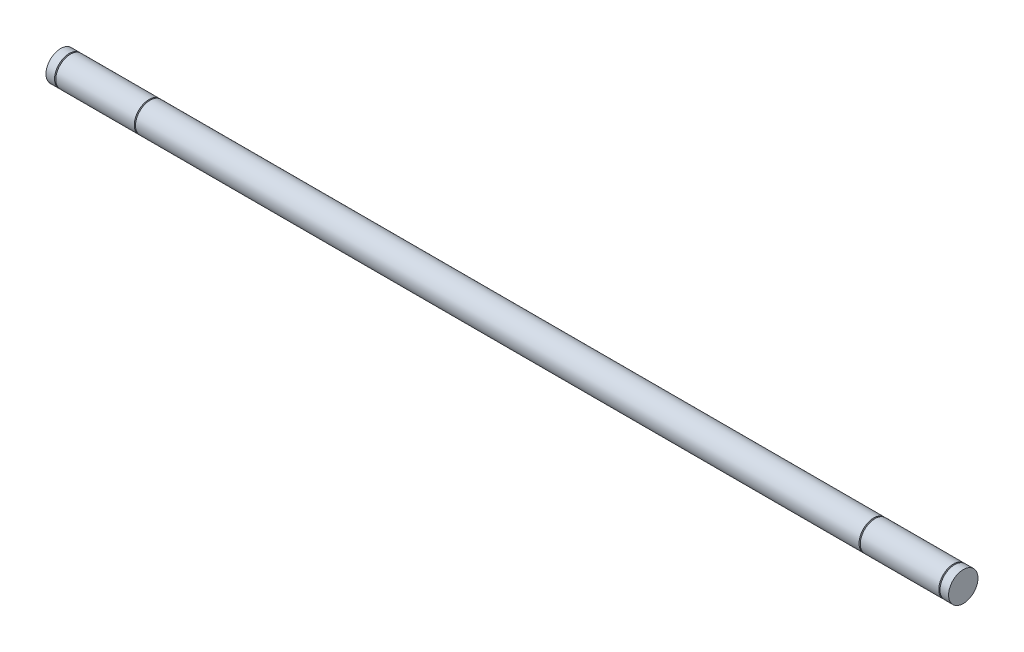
from build123d import *

# Parameters (mm, degrees)
SKETCH1_R               = 9.525
BOSS_EXTRUDE1_DEPTH     = 292.1
CUT_EXTRUDE_THIN1_START = -285.75
SKETCH1_2_R             = 9.525
SKETCH1_2_R_2           = 7.62
CUT_EXTRUDE_THIN1_DEPTH = 0.79375
CUT_EXTRUDE_THIN2_START = -234.15625
SKETCH1_3_R             = 9.525
SKETCH1_3_R_2           = 7.9375
CUT_EXTRUDE_THIN2_DEPTH = 0.79375


with BuildPart() as part:
    # Sketch1 → Boss-Extrude1 (new, symmetric)
    with BuildSketch(Plane(origin=(0, 0, 0), x_dir=(0, 0, -1), z_dir=(1, 0, 0))):
        Circle(SKETCH1_R)
    extrude(amount=BOSS_EXTRUDE1_DEPTH, both=True)

    # Sketch1_2 → Cut-Extrude-Thin1 (cut)
    with BuildSketch(Plane(origin=(0, 0, 0), x_dir=(0, 0, -1), z_dir=(1, 0, 0)).offset(CUT_EXTRUDE_THIN1_START)):
        Circle(SKETCH1_2_R)
        Circle(SKETCH1_2_R_2, mode=Mode.SUBTRACT)
    cut_extrude_thin1 = extrude(amount=-CUT_EXTRUDE_THIN1_DEPTH, mode=Mode.SUBTRACT)

    # Sketch1_3 → Cut-Extrude-Thin2 (cut)
    with BuildSketch(Plane(origin=(0, 0, 0), x_dir=(0, 0, -1), z_dir=(1, 0, 0)).offset(CUT_EXTRUDE_THIN2_START)):
        Circle(SKETCH1_3_R)
        Circle(SKETCH1_3_R_2, mode=Mode.SUBTRACT)
    cut_extrude_thin2 = extrude(amount=-CUT_EXTRUDE_THIN2_DEPTH, mode=Mode.SUBTRACT)

    # Mirror1: Cut-Extrude-Thin1, Cut-Extrude-Thin2 across plane
    add(cut_extrude_thin1.mirror(Plane(origin=(0, 0, 0), x_dir=(0, 0, 1), z_dir=(1, 0, 0))), mode=Mode.SUBTRACT)
    add(cut_extrude_thin2.mirror(Plane(origin=(0, 0, 0), x_dir=(0, 0, 1), z_dir=(1, 0, 0))), mode=Mode.SUBTRACT)


solid = part.part
